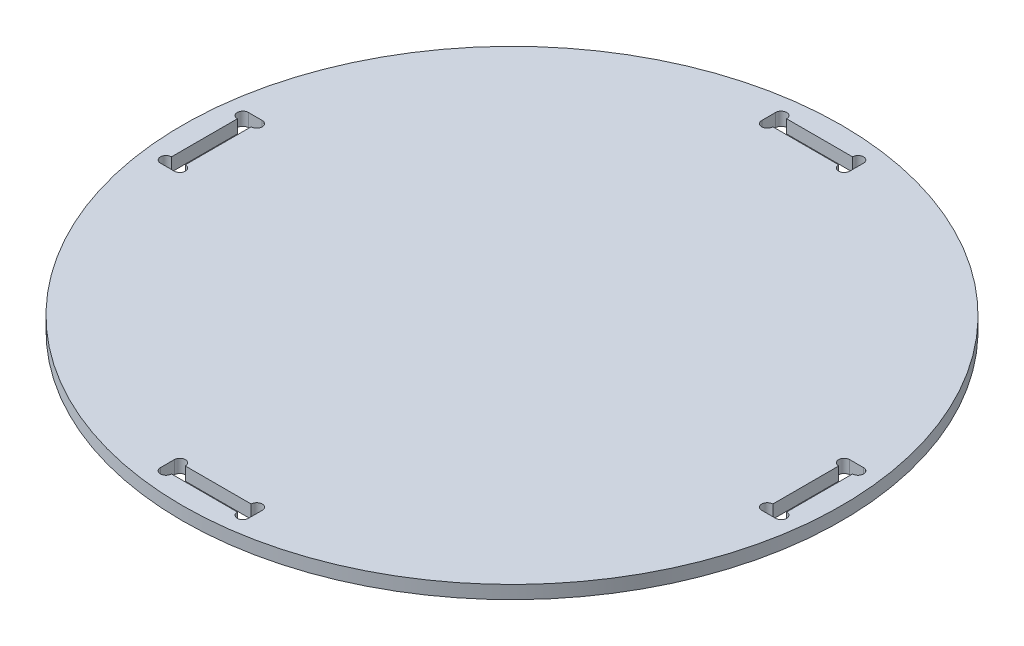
ISO-10303-21;
HEADER;
FILE_DESCRIPTION(('STEP AP214'),'2;1');
FILE_NAME('part.step','',(''),(''),'','','');
FILE_SCHEMA(('AUTOMOTIVE_DESIGN { 1 0 10303 214 1 1 1 1 }'));
ENDSEC;
DATA;
#1=APPLICATION_CONTEXT('core data for automotive mechanical design processes');
#2=APPLICATION_PROTOCOL_DEFINITION('international standard','automotive_design',2000,#1);
#3=PRODUCT_CONTEXT('',#1,'mechanical');
#4=PRODUCT('Part','Part','',(#3));
#5=PRODUCT_RELATED_PRODUCT_CATEGORY('part','',(#4));
#6=PRODUCT_DEFINITION_FORMATION('','',#4);
#7=PRODUCT_DEFINITION_CONTEXT('part definition',#1,'design');
#8=PRODUCT_DEFINITION('design','',#6,#7);
#9=PRODUCT_DEFINITION_SHAPE('','',#8);
#10=(LENGTH_UNIT() NAMED_UNIT(*) SI_UNIT(.MILLI.,.METRE.));
#11=(NAMED_UNIT(*) PLANE_ANGLE_UNIT() SI_UNIT($,.RADIAN.));
#12=(NAMED_UNIT(*) SI_UNIT($,.STERADIAN.) SOLID_ANGLE_UNIT());
#13=UNCERTAINTY_MEASURE_WITH_UNIT(LENGTH_MEASURE(1.E-05),#10,'distance_accuracy_value','');
#14=(GEOMETRIC_REPRESENTATION_CONTEXT(3) GLOBAL_UNCERTAINTY_ASSIGNED_CONTEXT((#13)) GLOBAL_UNIT_ASSIGNED_CONTEXT((#10,
#11,#12)) REPRESENTATION_CONTEXT('',''));
#15=CARTESIAN_POINT('',(0.,0.,0.));
#16=DIRECTION('',(0.,0.,1.));
#17=DIRECTION('',(1.,0.,0.));
#18=AXIS2_PLACEMENT_3D('',#15,#16,#17);
#19=CARTESIAN_POINT('',(0.,12.,0.));
#20=DIRECTION('',(0.,-1.,0.));
#21=DIRECTION('',(0.,0.,-1.));
#22=AXIS2_PLACEMENT_3D('',#19,#20,#21);
#23=CYLINDRICAL_SURFACE('',#22,300.);
#24=CARTESIAN_POINT('',(0.,12.,0.));
#25=DIRECTION('',(0.,1.,0.));
#26=DIRECTION('',(0.,0.,1.));
#27=AXIS2_PLACEMENT_3D('',#24,#25,#26);
#28=CIRCLE('',#27,300.);
#29=CARTESIAN_POINT('',(0.,12.,300.));
#30=VERTEX_POINT('',#29);
#31=EDGE_CURVE('E11',#30,#30,#28,.T.);
#32=ORIENTED_EDGE('',*,*,#31,.F.);
#33=EDGE_LOOP('',(#32));
#34=FACE_BOUND('',#33,.T.);
#35=CARTESIAN_POINT('',(0.,0.,0.));
#36=DIRECTION('',(0.,1.,0.));
#37=DIRECTION('',(0.,0.,1.));
#38=AXIS2_PLACEMENT_3D('',#35,#36,#37);
#39=CIRCLE('',#38,300.);
#40=CARTESIAN_POINT('',(0.,0.,300.));
#41=VERTEX_POINT('',#40);
#42=EDGE_CURVE('E37',#41,#41,#39,.T.);
#43=ORIENTED_EDGE('',*,*,#42,.T.);
#44=EDGE_LOOP('',(#43));
#45=FACE_BOUND('',#44,.T.);
#46=ADVANCED_FACE('F34',(#34,#45),#23,.T.);
#47=CARTESIAN_POINT('',(0.,12.,0.));
#48=DIRECTION('',(0.,1.,0.));
#49=DIRECTION('',(0.,0.,1.));
#50=AXIS2_PLACEMENT_3D('',#47,#48,#49);
#51=PLANE('',#50);
#52=CARTESIAN_POINT('',(34.9998061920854,12.,-280.044023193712));
#53=DIRECTION('',(0.,1.,0.));
#54=DIRECTION('',(0.,0.,-1.));
#55=AXIS2_PLACEMENT_3D('',#52,#53,#54);
#56=CIRCLE('',#55,5.);
#57=CARTESIAN_POINT('',(39.9996123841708,12.,-280.));
#58=VERTEX_POINT('',#57);
#59=CARTESIAN_POINT('',(30.,12.,-280.));
#60=VERTEX_POINT('',#59);
#61=EDGE_CURVE('E48',#58,#60,#56,.T.);
#62=ORIENTED_EDGE('',*,*,#61,.F.);
#63=DIRECTION('',(0.,0.,-1.));
#64=VECTOR('',#63,1.);
#65=CARTESIAN_POINT('',(39.9996123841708,12.,-280.));
#66=LINE('',#65,#64);
#67=CARTESIAN_POINT('',(39.9996123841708,12.,-267.4));
#68=VERTEX_POINT('',#67);
#69=EDGE_CURVE('E264',#68,#58,#66,.T.);
#70=ORIENTED_EDGE('',*,*,#69,.F.);
#71=CARTESIAN_POINT('',(34.9998061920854,12.,-267.355976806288));
#72=DIRECTION('',(0.,1.,0.));
#73=DIRECTION('',(0.,0.,1.));
#74=AXIS2_PLACEMENT_3D('',#71,#72,#73);
#75=CIRCLE('',#74,5.00000000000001);
#76=CARTESIAN_POINT('',(30.,12.,-267.4));
#77=VERTEX_POINT('',#76);
#78=EDGE_CURVE('E267',#77,#68,#75,.T.);
#79=ORIENTED_EDGE('',*,*,#78,.F.);
#80=DIRECTION('',(1.,0.,0.));
#81=VECTOR('',#80,1.);
#82=CARTESIAN_POINT('',(-30.,12.,-267.4));
#83=LINE('',#82,#81);
#84=CARTESIAN_POINT('',(-30.,12.,-267.4));
#85=VERTEX_POINT('',#84);
#86=EDGE_CURVE('E296',#85,#77,#83,.T.);
#87=ORIENTED_EDGE('',*,*,#86,.F.);
#88=CARTESIAN_POINT('',(-34.9998061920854,12.,-267.355976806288));
#89=DIRECTION('',(0.,1.,0.));
#90=DIRECTION('',(0.,0.,-1.));
#91=AXIS2_PLACEMENT_3D('',#88,#89,#90);
#92=CIRCLE('',#91,5.);
#93=CARTESIAN_POINT('',(-39.9996123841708,12.,-267.4));
#94=VERTEX_POINT('',#93);
#95=EDGE_CURVE('E293',#94,#85,#92,.T.);
#96=ORIENTED_EDGE('',*,*,#95,.F.);
#97=DIRECTION('',(0.,0.,1.));
#98=VECTOR('',#97,1.);
#99=CARTESIAN_POINT('',(-39.9996123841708,12.,-280.));
#100=LINE('',#99,#98);
#101=CARTESIAN_POINT('',(-39.9996123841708,12.,-280.));
#102=VERTEX_POINT('',#101);
#103=EDGE_CURVE('E290',#102,#94,#100,.T.);
#104=ORIENTED_EDGE('',*,*,#103,.F.);
#105=CARTESIAN_POINT('',(-34.9998061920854,12.,-280.044023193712));
#106=DIRECTION('',(0.,1.,0.));
#107=DIRECTION('',(0.,0.,1.));
#108=AXIS2_PLACEMENT_3D('',#105,#106,#107);
#109=CIRCLE('',#108,5.);
#110=CARTESIAN_POINT('',(-30.,12.,-280.));
#111=VERTEX_POINT('',#110);
#112=EDGE_CURVE('E287',#111,#102,#109,.T.);
#113=ORIENTED_EDGE('',*,*,#112,.F.);
#114=DIRECTION('',(-1.,0.,0.));
#115=VECTOR('',#114,1.);
#116=CARTESIAN_POINT('',(-30.,12.,-280.));
#117=LINE('',#116,#115);
#118=EDGE_CURVE('E284',#60,#111,#117,.T.);
#119=ORIENTED_EDGE('',*,*,#118,.F.);
#120=EDGE_LOOP('',(#62,#70,#79,#87,#96,#104,#113,#119));
#121=FACE_BOUND('',#120,.T.);
#122=CARTESIAN_POINT('',(280.044023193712,12.,34.9998061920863));
#123=DIRECTION('',(0.,1.,0.));
#124=DIRECTION('',(0.,0.,-1.));
#125=AXIS2_PLACEMENT_3D('',#122,#123,#124);
#126=CIRCLE('',#125,5.);
#127=CARTESIAN_POINT('',(280.,12.,39.9996123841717));
#128=VERTEX_POINT('',#127);
#129=CARTESIAN_POINT('',(280.,12.,30.0000000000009));
#130=VERTEX_POINT('',#129);
#131=EDGE_CURVE('E56',#128,#130,#126,.T.);
#132=ORIENTED_EDGE('',*,*,#131,.F.);
#133=DIRECTION('',(1.,0.,0.));
#134=VECTOR('',#133,1.);
#135=CARTESIAN_POINT('',(280.,12.,39.9996123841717));
#136=LINE('',#135,#134);
#137=CARTESIAN_POINT('',(267.4,12.,39.9996123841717));
#138=VERTEX_POINT('',#137);
#139=EDGE_CURVE('E318',#138,#128,#136,.T.);
#140=ORIENTED_EDGE('',*,*,#139,.F.);
#141=CARTESIAN_POINT('',(267.355976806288,12.,34.9998061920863));
#142=DIRECTION('',(0.,1.,0.));
#143=DIRECTION('',(0.,0.,1.));
#144=AXIS2_PLACEMENT_3D('',#141,#142,#143);
#145=CIRCLE('',#144,5.00000000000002);
#146=CARTESIAN_POINT('',(267.4,12.,30.0000000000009));
#147=VERTEX_POINT('',#146);
#148=EDGE_CURVE('E357',#147,#138,#145,.T.);
#149=ORIENTED_EDGE('',*,*,#148,.F.);
#150=DIRECTION('',(0.,0.,1.));
#151=VECTOR('',#150,1.);
#152=CARTESIAN_POINT('',(267.4,12.,-29.9999999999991));
#153=LINE('',#152,#151);
#154=CARTESIAN_POINT('',(267.4,12.,-29.9999999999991));
#155=VERTEX_POINT('',#154);
#156=EDGE_CURVE('E354',#155,#147,#153,.T.);
#157=ORIENTED_EDGE('',*,*,#156,.F.);
#158=CARTESIAN_POINT('',(267.355976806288,12.,-34.9998061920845));
#159=DIRECTION('',(0.,1.,0.));
#160=DIRECTION('',(0.,0.,-1.));
#161=AXIS2_PLACEMENT_3D('',#158,#159,#160);
#162=CIRCLE('',#161,5.);
#163=CARTESIAN_POINT('',(267.4,12.,-39.9996123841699));
#164=VERTEX_POINT('',#163);
#165=EDGE_CURVE('E351',#164,#155,#162,.T.);
#166=ORIENTED_EDGE('',*,*,#165,.F.);
#167=DIRECTION('',(-1.,0.,0.));
#168=VECTOR('',#167,1.);
#169=CARTESIAN_POINT('',(280.,12.,-39.9996123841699));
#170=LINE('',#169,#168);
#171=CARTESIAN_POINT('',(280.,12.,-39.9996123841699));
#172=VERTEX_POINT('',#171);
#173=EDGE_CURVE('E348',#172,#164,#170,.T.);
#174=ORIENTED_EDGE('',*,*,#173,.F.);
#175=CARTESIAN_POINT('',(280.044023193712,12.,-34.9998061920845));
#176=DIRECTION('',(0.,1.,0.));
#177=DIRECTION('',(0.,0.,1.));
#178=AXIS2_PLACEMENT_3D('',#175,#176,#177);
#179=CIRCLE('',#178,5.);
#180=CARTESIAN_POINT('',(280.,12.,-29.9999999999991));
#181=VERTEX_POINT('',#180);
#182=EDGE_CURVE('E345',#181,#172,#179,.T.);
#183=ORIENTED_EDGE('',*,*,#182,.F.);
#184=DIRECTION('',(0.,0.,-1.));
#185=VECTOR('',#184,1.);
#186=CARTESIAN_POINT('',(280.,12.,-29.9999999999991));
#187=LINE('',#186,#185);
#188=EDGE_CURVE('E341',#130,#181,#187,.T.);
#189=ORIENTED_EDGE('',*,*,#188,.F.);
#190=EDGE_LOOP('',(#132,#140,#149,#157,#166,#174,#183,#189));
#191=FACE_BOUND('',#190,.T.);
#192=CARTESIAN_POINT('',(-34.9998061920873,12.,280.044023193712));
#193=DIRECTION('',(0.,1.,0.));
#194=DIRECTION('',(0.,0.,-1.));
#195=AXIS2_PLACEMENT_3D('',#192,#193,#194);
#196=CIRCLE('',#195,5.);
#197=CARTESIAN_POINT('',(-39.9996123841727,12.,280.));
#198=VERTEX_POINT('',#197);
#199=CARTESIAN_POINT('',(-30.000000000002,12.,280.));
#200=VERTEX_POINT('',#199);
#201=EDGE_CURVE('E402',#198,#200,#196,.T.);
#202=ORIENTED_EDGE('',*,*,#201,.F.);
#203=DIRECTION('',(0.,0.,1.));
#204=VECTOR('',#203,1.);
#205=CARTESIAN_POINT('',(-39.9996123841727,12.,280.));
#206=LINE('',#205,#204);
#207=CARTESIAN_POINT('',(-39.9996123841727,12.,267.4));
#208=VERTEX_POINT('',#207);
#209=EDGE_CURVE('E380',#208,#198,#206,.T.);
#210=ORIENTED_EDGE('',*,*,#209,.F.);
#211=CARTESIAN_POINT('',(-34.9998061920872,12.,267.355976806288));
#212=DIRECTION('',(0.,1.,0.));
#213=DIRECTION('',(0.,0.,1.));
#214=AXIS2_PLACEMENT_3D('',#211,#212,#213);
#215=CIRCLE('',#214,5.00000000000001);
#216=CARTESIAN_POINT('',(-30.0000000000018,12.,267.4));
#217=VERTEX_POINT('',#216);
#218=EDGE_CURVE('E420',#217,#208,#215,.T.);
#219=ORIENTED_EDGE('',*,*,#218,.F.);
#220=DIRECTION('',(-1.,0.,0.));
#221=VECTOR('',#220,1.);
#222=CARTESIAN_POINT('',(29.9999999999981,12.,267.4));
#223=LINE('',#222,#221);
#224=CARTESIAN_POINT('',(29.9999999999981,12.,267.4));
#225=VERTEX_POINT('',#224);
#226=EDGE_CURVE('E417',#225,#217,#223,.T.);
#227=ORIENTED_EDGE('',*,*,#226,.F.);
#228=CARTESIAN_POINT('',(34.9998061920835,12.,267.355976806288));
#229=DIRECTION('',(0.,1.,0.));
#230=DIRECTION('',(0.,0.,-1.));
#231=AXIS2_PLACEMENT_3D('',#228,#229,#230);
#232=CIRCLE('',#231,5.);
#233=CARTESIAN_POINT('',(39.9996123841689,12.,267.4));
#234=VERTEX_POINT('',#233);
#235=EDGE_CURVE('E414',#234,#225,#232,.T.);
#236=ORIENTED_EDGE('',*,*,#235,.F.);
#237=DIRECTION('',(0.,0.,-1.));
#238=VECTOR('',#237,1.);
#239=CARTESIAN_POINT('',(39.9996123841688,12.,280.));
#240=LINE('',#239,#238);
#241=CARTESIAN_POINT('',(39.9996123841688,12.,280.));
#242=VERTEX_POINT('',#241);
#243=EDGE_CURVE('E411',#242,#234,#240,.T.);
#244=ORIENTED_EDGE('',*,*,#243,.F.);
#245=CARTESIAN_POINT('',(34.9998061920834,12.,280.044023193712));
#246=DIRECTION('',(0.,1.,0.));
#247=DIRECTION('',(0.,0.,1.));
#248=AXIS2_PLACEMENT_3D('',#245,#246,#247);
#249=CIRCLE('',#248,5.);
#250=CARTESIAN_POINT('',(29.999999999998,12.,280.));
#251=VERTEX_POINT('',#250);
#252=EDGE_CURVE('E408',#251,#242,#249,.T.);
#253=ORIENTED_EDGE('',*,*,#252,.F.);
#254=DIRECTION('',(1.,0.,0.));
#255=VECTOR('',#254,1.);
#256=CARTESIAN_POINT('',(29.999999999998,12.,280.));
#257=LINE('',#256,#255);
#258=EDGE_CURVE('E404',#200,#251,#257,.T.);
#259=ORIENTED_EDGE('',*,*,#258,.F.);
#260=EDGE_LOOP('',(#202,#210,#219,#227,#236,#244,#253,#259));
#261=FACE_BOUND('',#260,.T.);
#262=CARTESIAN_POINT('',(-280.044023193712,12.,-34.9998061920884));
#263=DIRECTION('',(0.,1.,0.));
#264=DIRECTION('',(0.,0.,-1.));
#265=AXIS2_PLACEMENT_3D('',#262,#263,#264);
#266=CIRCLE('',#265,5.);
#267=CARTESIAN_POINT('',(-280.,12.,-39.9996123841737));
#268=VERTEX_POINT('',#267);
#269=CARTESIAN_POINT('',(-280.,12.,-30.000000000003));
#270=VERTEX_POINT('',#269);
#271=EDGE_CURVE('E466',#268,#270,#266,.T.);
#272=ORIENTED_EDGE('',*,*,#271,.F.);
#273=DIRECTION('',(-1.,0.,0.));
#274=VECTOR('',#273,1.);
#275=CARTESIAN_POINT('',(-280.,12.,-39.9996123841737));
#276=LINE('',#275,#274);
#277=CARTESIAN_POINT('',(-267.4,12.,-39.9996123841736));
#278=VERTEX_POINT('',#277);
#279=EDGE_CURVE('E444',#278,#268,#276,.T.);
#280=ORIENTED_EDGE('',*,*,#279,.F.);
#281=CARTESIAN_POINT('',(-267.355976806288,12.,-34.9998061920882));
#282=DIRECTION('',(0.,1.,0.));
#283=DIRECTION('',(0.,0.,1.));
#284=AXIS2_PLACEMENT_3D('',#281,#282,#283);
#285=CIRCLE('',#284,5.00000000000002);
#286=CARTESIAN_POINT('',(-267.4,12.,-30.0000000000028));
#287=VERTEX_POINT('',#286);
#288=EDGE_CURVE('E483',#287,#278,#285,.T.);
#289=ORIENTED_EDGE('',*,*,#288,.F.);
#290=DIRECTION('',(0.,0.,-1.));
#291=VECTOR('',#290,1.);
#292=CARTESIAN_POINT('',(-267.4,12.,29.9999999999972));
#293=LINE('',#292,#291);
#294=CARTESIAN_POINT('',(-267.4,12.,29.9999999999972));
#295=VERTEX_POINT('',#294);
#296=EDGE_CURVE('E480',#295,#287,#293,.T.);
#297=ORIENTED_EDGE('',*,*,#296,.F.);
#298=CARTESIAN_POINT('',(-267.355976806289,12.,34.9998061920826));
#299=DIRECTION('',(0.,1.,0.));
#300=DIRECTION('',(0.,0.,-1.));
#301=AXIS2_PLACEMENT_3D('',#298,#299,#300);
#302=CIRCLE('',#301,5.);
#303=CARTESIAN_POINT('',(-267.400000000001,12.,39.999612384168));
#304=VERTEX_POINT('',#303);
#305=EDGE_CURVE('E477',#304,#295,#302,.T.);
#306=ORIENTED_EDGE('',*,*,#305,.F.);
#307=DIRECTION('',(1.,0.,0.));
#308=VECTOR('',#307,1.);
#309=CARTESIAN_POINT('',(-280.000000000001,12.,39.9996123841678));
#310=LINE('',#309,#308);
#311=CARTESIAN_POINT('',(-280.000000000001,12.,39.9996123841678));
#312=VERTEX_POINT('',#311);
#313=EDGE_CURVE('E474',#312,#304,#310,.T.);
#314=ORIENTED_EDGE('',*,*,#313,.F.);
#315=CARTESIAN_POINT('',(-280.044023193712,12.,34.9998061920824));
#316=DIRECTION('',(0.,1.,0.));
#317=DIRECTION('',(0.,0.,1.));
#318=AXIS2_PLACEMENT_3D('',#315,#316,#317);
#319=CIRCLE('',#318,5.);
#320=CARTESIAN_POINT('',(-280.,12.,29.999999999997));
#321=VERTEX_POINT('',#320);
#322=EDGE_CURVE('E471',#321,#312,#319,.T.);
#323=ORIENTED_EDGE('',*,*,#322,.F.);
#324=DIRECTION('',(0.,0.,1.));
#325=VECTOR('',#324,1.);
#326=CARTESIAN_POINT('',(-280.,12.,29.999999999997));
#327=LINE('',#326,#325);
#328=EDGE_CURVE('E468',#270,#321,#327,.T.);
#329=ORIENTED_EDGE('',*,*,#328,.F.);
#330=EDGE_LOOP('',(#272,#280,#289,#297,#306,#314,#323,#329));
#331=FACE_BOUND('',#330,.T.);
#332=ORIENTED_EDGE('',*,*,#31,.T.);
#333=EDGE_LOOP('',(#332));
#334=FACE_BOUND('',#333,.T.);
#335=ADVANCED_FACE('F512',(#121,#191,#261,#331,#334),#51,.T.);
#336=CARTESIAN_POINT('',(0.,0.,0.));
#337=DIRECTION('',(0.,1.,0.));
#338=DIRECTION('',(0.,0.,1.));
#339=AXIS2_PLACEMENT_3D('',#336,#337,#338);
#340=PLANE('',#339);
#341=DIRECTION('',(0.,0.,-1.));
#342=VECTOR('',#341,1.);
#343=CARTESIAN_POINT('',(39.9996123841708,0.,-280.));
#344=LINE('',#343,#342);
#345=CARTESIAN_POINT('',(39.9996123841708,0.,-267.4));
#346=VERTEX_POINT('',#345);
#347=CARTESIAN_POINT('',(39.9996123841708,0.,-280.));
#348=VERTEX_POINT('',#347);
#349=EDGE_CURVE('E250',#346,#348,#344,.T.);
#350=ORIENTED_EDGE('',*,*,#349,.T.);
#351=CARTESIAN_POINT('',(34.9998061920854,0.,-280.044023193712));
#352=DIRECTION('',(0.,1.,0.));
#353=DIRECTION('',(0.,0.,-1.));
#354=AXIS2_PLACEMENT_3D('',#351,#352,#353);
#355=CIRCLE('',#354,5.);
#356=CARTESIAN_POINT('',(30.,0.,-280.));
#357=VERTEX_POINT('',#356);
#358=EDGE_CURVE('E244',#348,#357,#355,.T.);
#359=ORIENTED_EDGE('',*,*,#358,.T.);
#360=DIRECTION('',(-1.,0.,0.));
#361=VECTOR('',#360,1.);
#362=CARTESIAN_POINT('',(-30.,0.,-280.));
#363=LINE('',#362,#361);
#364=CARTESIAN_POINT('',(-30.,0.,-280.));
#365=VERTEX_POINT('',#364);
#366=EDGE_CURVE('E254',#357,#365,#363,.T.);
#367=ORIENTED_EDGE('',*,*,#366,.T.);
#368=CARTESIAN_POINT('',(-34.9998061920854,0.,-280.044023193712));
#369=DIRECTION('',(0.,1.,0.));
#370=DIRECTION('',(0.,0.,1.));
#371=AXIS2_PLACEMENT_3D('',#368,#369,#370);
#372=CIRCLE('',#371,5.);
#373=CARTESIAN_POINT('',(-39.9996123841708,0.,-280.));
#374=VERTEX_POINT('',#373);
#375=EDGE_CURVE('E258',#365,#374,#372,.T.);
#376=ORIENTED_EDGE('',*,*,#375,.T.);
#377=DIRECTION('',(0.,0.,1.));
#378=VECTOR('',#377,1.);
#379=CARTESIAN_POINT('',(-39.9996123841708,0.,-280.));
#380=LINE('',#379,#378);
#381=CARTESIAN_POINT('',(-39.9996123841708,0.,-267.4));
#382=VERTEX_POINT('',#381);
#383=EDGE_CURVE('E271',#374,#382,#380,.T.);
#384=ORIENTED_EDGE('',*,*,#383,.T.);
#385=CARTESIAN_POINT('',(-34.9998061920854,0.,-267.355976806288));
#386=DIRECTION('',(0.,1.,0.));
#387=DIRECTION('',(0.,0.,-1.));
#388=AXIS2_PLACEMENT_3D('',#385,#386,#387);
#389=CIRCLE('',#388,5.);
#390=CARTESIAN_POINT('',(-30.,0.,-267.4));
#391=VERTEX_POINT('',#390);
#392=EDGE_CURVE('E274',#382,#391,#389,.T.);
#393=ORIENTED_EDGE('',*,*,#392,.T.);
#394=DIRECTION('',(1.,0.,0.));
#395=VECTOR('',#394,1.);
#396=CARTESIAN_POINT('',(-30.,0.,-267.4));
#397=LINE('',#396,#395);
#398=CARTESIAN_POINT('',(30.,0.,-267.4));
#399=VERTEX_POINT('',#398);
#400=EDGE_CURVE('E277',#391,#399,#397,.T.);
#401=ORIENTED_EDGE('',*,*,#400,.T.);
#402=CARTESIAN_POINT('',(34.9998061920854,0.,-267.355976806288));
#403=DIRECTION('',(0.,1.,0.));
#404=DIRECTION('',(0.,0.,1.));
#405=AXIS2_PLACEMENT_3D('',#402,#403,#404);
#406=CIRCLE('',#405,5.00000000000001);
#407=EDGE_CURVE('E280',#399,#346,#406,.T.);
#408=ORIENTED_EDGE('',*,*,#407,.T.);
#409=EDGE_LOOP('',(#350,#359,#367,#376,#384,#393,#401,#408));
#410=FACE_BOUND('',#409,.T.);
#411=DIRECTION('',(1.,0.,0.));
#412=VECTOR('',#411,1.);
#413=CARTESIAN_POINT('',(280.,0.,39.9996123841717));
#414=LINE('',#413,#412);
#415=CARTESIAN_POINT('',(267.4,0.,39.9996123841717));
#416=VERTEX_POINT('',#415);
#417=CARTESIAN_POINT('',(280.,0.,39.9996123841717));
#418=VERTEX_POINT('',#417);
#419=EDGE_CURVE('E336',#416,#418,#414,.T.);
#420=ORIENTED_EDGE('',*,*,#419,.T.);
#421=CARTESIAN_POINT('',(280.044023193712,0.,34.9998061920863));
#422=DIRECTION('',(0.,1.,0.));
#423=DIRECTION('',(0.,0.,-1.));
#424=AXIS2_PLACEMENT_3D('',#421,#422,#423);
#425=CIRCLE('',#424,5.);
#426=CARTESIAN_POINT('',(280.,0.,30.0000000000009));
#427=VERTEX_POINT('',#426);
#428=EDGE_CURVE('E314',#418,#427,#425,.T.);
#429=ORIENTED_EDGE('',*,*,#428,.T.);
#430=DIRECTION('',(0.,0.,-1.));
#431=VECTOR('',#430,1.);
#432=CARTESIAN_POINT('',(280.,0.,-29.9999999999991));
#433=LINE('',#432,#431);
#434=CARTESIAN_POINT('',(280.,0.,-29.9999999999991));
#435=VERTEX_POINT('',#434);
#436=EDGE_CURVE('E317',#427,#435,#433,.T.);
#437=ORIENTED_EDGE('',*,*,#436,.T.);
#438=CARTESIAN_POINT('',(280.044023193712,0.,-34.9998061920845));
#439=DIRECTION('',(0.,1.,0.));
#440=DIRECTION('',(0.,0.,1.));
#441=AXIS2_PLACEMENT_3D('',#438,#439,#440);
#442=CIRCLE('',#441,5.);
#443=CARTESIAN_POINT('',(280.,0.,-39.9996123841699));
#444=VERTEX_POINT('',#443);
#445=EDGE_CURVE('E321',#435,#444,#442,.T.);
#446=ORIENTED_EDGE('',*,*,#445,.T.);
#447=DIRECTION('',(-1.,0.,0.));
#448=VECTOR('',#447,1.);
#449=CARTESIAN_POINT('',(280.,0.,-39.9996123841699));
#450=LINE('',#449,#448);
#451=CARTESIAN_POINT('',(267.4,0.,-39.9996123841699));
#452=VERTEX_POINT('',#451);
#453=EDGE_CURVE('E324',#444,#452,#450,.T.);
#454=ORIENTED_EDGE('',*,*,#453,.T.);
#455=CARTESIAN_POINT('',(267.355976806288,0.,-34.9998061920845));
#456=DIRECTION('',(0.,1.,0.));
#457=DIRECTION('',(0.,0.,-1.));
#458=AXIS2_PLACEMENT_3D('',#455,#456,#457);
#459=CIRCLE('',#458,5.);
#460=CARTESIAN_POINT('',(267.4,0.,-29.9999999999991));
#461=VERTEX_POINT('',#460);
#462=EDGE_CURVE('E327',#452,#461,#459,.T.);
#463=ORIENTED_EDGE('',*,*,#462,.T.);
#464=DIRECTION('',(0.,0.,1.));
#465=VECTOR('',#464,1.);
#466=CARTESIAN_POINT('',(267.4,0.,-29.9999999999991));
#467=LINE('',#466,#465);
#468=CARTESIAN_POINT('',(267.4,0.,30.0000000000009));
#469=VERTEX_POINT('',#468);
#470=EDGE_CURVE('E330',#461,#469,#467,.T.);
#471=ORIENTED_EDGE('',*,*,#470,.T.);
#472=CARTESIAN_POINT('',(267.355976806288,0.,34.9998061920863));
#473=DIRECTION('',(0.,1.,0.));
#474=DIRECTION('',(0.,0.,1.));
#475=AXIS2_PLACEMENT_3D('',#472,#473,#474);
#476=CIRCLE('',#475,5.00000000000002);
#477=EDGE_CURVE('E333',#469,#416,#476,.T.);
#478=ORIENTED_EDGE('',*,*,#477,.T.);
#479=EDGE_LOOP('',(#420,#429,#437,#446,#454,#463,#471,#478));
#480=FACE_BOUND('',#479,.T.);
#481=DIRECTION('',(0.,0.,1.));
#482=VECTOR('',#481,1.);
#483=CARTESIAN_POINT('',(-39.9996123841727,0.,280.));
#484=LINE('',#483,#482);
#485=CARTESIAN_POINT('',(-39.9996123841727,0.,267.4));
#486=VERTEX_POINT('',#485);
#487=CARTESIAN_POINT('',(-39.9996123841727,0.,280.));
#488=VERTEX_POINT('',#487);
#489=EDGE_CURVE('E398',#486,#488,#484,.T.);
#490=ORIENTED_EDGE('',*,*,#489,.T.);
#491=CARTESIAN_POINT('',(-34.9998061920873,0.,280.044023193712));
#492=DIRECTION('',(0.,1.,0.));
#493=DIRECTION('',(0.,0.,-1.));
#494=AXIS2_PLACEMENT_3D('',#491,#492,#493);
#495=CIRCLE('',#494,5.);
#496=CARTESIAN_POINT('',(-30.000000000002,0.,280.));
#497=VERTEX_POINT('',#496);
#498=EDGE_CURVE('E376',#488,#497,#495,.T.);
#499=ORIENTED_EDGE('',*,*,#498,.T.);
#500=DIRECTION('',(1.,0.,0.));
#501=VECTOR('',#500,1.);
#502=CARTESIAN_POINT('',(29.999999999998,0.,280.));
#503=LINE('',#502,#501);
#504=CARTESIAN_POINT('',(29.999999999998,0.,280.));
#505=VERTEX_POINT('',#504);
#506=EDGE_CURVE('E379',#497,#505,#503,.T.);
#507=ORIENTED_EDGE('',*,*,#506,.T.);
#508=CARTESIAN_POINT('',(34.9998061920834,0.,280.044023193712));
#509=DIRECTION('',(0.,1.,0.));
#510=DIRECTION('',(0.,0.,1.));
#511=AXIS2_PLACEMENT_3D('',#508,#509,#510);
#512=CIRCLE('',#511,5.);
#513=CARTESIAN_POINT('',(39.9996123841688,0.,280.));
#514=VERTEX_POINT('',#513);
#515=EDGE_CURVE('E383',#505,#514,#512,.T.);
#516=ORIENTED_EDGE('',*,*,#515,.T.);
#517=DIRECTION('',(0.,0.,-1.));
#518=VECTOR('',#517,1.);
#519=CARTESIAN_POINT('',(39.9996123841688,0.,280.));
#520=LINE('',#519,#518);
#521=CARTESIAN_POINT('',(39.9996123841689,0.,267.4));
#522=VERTEX_POINT('',#521);
#523=EDGE_CURVE('E386',#514,#522,#520,.T.);
#524=ORIENTED_EDGE('',*,*,#523,.T.);
#525=CARTESIAN_POINT('',(34.9998061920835,0.,267.355976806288));
#526=DIRECTION('',(0.,1.,0.));
#527=DIRECTION('',(0.,0.,-1.));
#528=AXIS2_PLACEMENT_3D('',#525,#526,#527);
#529=CIRCLE('',#528,5.);
#530=CARTESIAN_POINT('',(29.9999999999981,0.,267.4));
#531=VERTEX_POINT('',#530);
#532=EDGE_CURVE('E389',#522,#531,#529,.T.);
#533=ORIENTED_EDGE('',*,*,#532,.T.);
#534=DIRECTION('',(-1.,0.,0.));
#535=VECTOR('',#534,1.);
#536=CARTESIAN_POINT('',(29.9999999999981,0.,267.4));
#537=LINE('',#536,#535);
#538=CARTESIAN_POINT('',(-30.0000000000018,0.,267.4));
#539=VERTEX_POINT('',#538);
#540=EDGE_CURVE('E392',#531,#539,#537,.T.);
#541=ORIENTED_EDGE('',*,*,#540,.T.);
#542=CARTESIAN_POINT('',(-34.9998061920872,0.,267.355976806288));
#543=DIRECTION('',(0.,1.,0.));
#544=DIRECTION('',(0.,0.,1.));
#545=AXIS2_PLACEMENT_3D('',#542,#543,#544);
#546=CIRCLE('',#545,5.00000000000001);
#547=EDGE_CURVE('E395',#539,#486,#546,.T.);
#548=ORIENTED_EDGE('',*,*,#547,.T.);
#549=EDGE_LOOP('',(#490,#499,#507,#516,#524,#533,#541,#548));
#550=FACE_BOUND('',#549,.T.);
#551=DIRECTION('',(-1.,0.,0.));
#552=VECTOR('',#551,1.);
#553=CARTESIAN_POINT('',(-280.,0.,-39.9996123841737));
#554=LINE('',#553,#552);
#555=CARTESIAN_POINT('',(-267.4,0.,-39.9996123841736));
#556=VERTEX_POINT('',#555);
#557=CARTESIAN_POINT('',(-280.,0.,-39.9996123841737));
#558=VERTEX_POINT('',#557);
#559=EDGE_CURVE('E462',#556,#558,#554,.T.);
#560=ORIENTED_EDGE('',*,*,#559,.T.);
#561=CARTESIAN_POINT('',(-280.044023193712,0.,-34.9998061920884));
#562=DIRECTION('',(0.,1.,0.));
#563=DIRECTION('',(0.,0.,-1.));
#564=AXIS2_PLACEMENT_3D('',#561,#562,#563);
#565=CIRCLE('',#564,5.);
#566=CARTESIAN_POINT('',(-280.,0.,-30.000000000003));
#567=VERTEX_POINT('',#566);
#568=EDGE_CURVE('E440',#558,#567,#565,.T.);
#569=ORIENTED_EDGE('',*,*,#568,.T.);
#570=DIRECTION('',(0.,0.,1.));
#571=VECTOR('',#570,1.);
#572=CARTESIAN_POINT('',(-280.,0.,29.999999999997));
#573=LINE('',#572,#571);
#574=CARTESIAN_POINT('',(-280.,0.,29.999999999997));
#575=VERTEX_POINT('',#574);
#576=EDGE_CURVE('E443',#567,#575,#573,.T.);
#577=ORIENTED_EDGE('',*,*,#576,.T.);
#578=CARTESIAN_POINT('',(-280.044023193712,0.,34.9998061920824));
#579=DIRECTION('',(0.,1.,0.));
#580=DIRECTION('',(0.,0.,1.));
#581=AXIS2_PLACEMENT_3D('',#578,#579,#580);
#582=CIRCLE('',#581,5.);
#583=CARTESIAN_POINT('',(-280.000000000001,0.,39.9996123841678));
#584=VERTEX_POINT('',#583);
#585=EDGE_CURVE('E447',#575,#584,#582,.T.);
#586=ORIENTED_EDGE('',*,*,#585,.T.);
#587=DIRECTION('',(1.,0.,0.));
#588=VECTOR('',#587,1.);
#589=CARTESIAN_POINT('',(-280.000000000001,0.,39.9996123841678));
#590=LINE('',#589,#588);
#591=CARTESIAN_POINT('',(-267.400000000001,0.,39.999612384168));
#592=VERTEX_POINT('',#591);
#593=EDGE_CURVE('E450',#584,#592,#590,.T.);
#594=ORIENTED_EDGE('',*,*,#593,.T.);
#595=CARTESIAN_POINT('',(-267.355976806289,0.,34.9998061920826));
#596=DIRECTION('',(0.,1.,0.));
#597=DIRECTION('',(0.,0.,-1.));
#598=AXIS2_PLACEMENT_3D('',#595,#596,#597);
#599=CIRCLE('',#598,5.);
#600=CARTESIAN_POINT('',(-267.4,0.,29.9999999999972));
#601=VERTEX_POINT('',#600);
#602=EDGE_CURVE('E453',#592,#601,#599,.T.);
#603=ORIENTED_EDGE('',*,*,#602,.T.);
#604=DIRECTION('',(0.,0.,-1.));
#605=VECTOR('',#604,1.);
#606=CARTESIAN_POINT('',(-267.4,0.,29.9999999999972));
#607=LINE('',#606,#605);
#608=CARTESIAN_POINT('',(-267.4,0.,-30.0000000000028));
#609=VERTEX_POINT('',#608);
#610=EDGE_CURVE('E456',#601,#609,#607,.T.);
#611=ORIENTED_EDGE('',*,*,#610,.T.);
#612=CARTESIAN_POINT('',(-267.355976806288,0.,-34.9998061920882));
#613=DIRECTION('',(0.,1.,0.));
#614=DIRECTION('',(0.,0.,1.));
#615=AXIS2_PLACEMENT_3D('',#612,#613,#614);
#616=CIRCLE('',#615,5.00000000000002);
#617=EDGE_CURVE('E459',#609,#556,#616,.T.);
#618=ORIENTED_EDGE('',*,*,#617,.T.);
#619=EDGE_LOOP('',(#560,#569,#577,#586,#594,#603,#611,#618));
#620=FACE_BOUND('',#619,.T.);
#621=ORIENTED_EDGE('',*,*,#42,.F.);
#622=EDGE_LOOP('',(#621));
#623=FACE_BOUND('',#622,.T.);
#624=ADVANCED_FACE('F260',(#410,#480,#550,#620,#623),#340,.F.);
#625=CARTESIAN_POINT('',(-280.044023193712,0.,-34.9998061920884));
#626=DIRECTION('',(0.,1.,0.));
#627=DIRECTION('',(0.,0.,1.));
#628=AXIS2_PLACEMENT_3D('',#625,#626,#627);
#629=CYLINDRICAL_SURFACE('',#628,5.);
#630=ORIENTED_EDGE('',*,*,#271,.T.);
#631=DIRECTION('',(0.,1.,0.));
#632=VECTOR('',#631,1.);
#633=CARTESIAN_POINT('',(-280.,0.,-30.000000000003));
#634=LINE('',#633,#632);
#635=EDGE_CURVE('E465',#567,#270,#634,.T.);
#636=ORIENTED_EDGE('',*,*,#635,.F.);
#637=ORIENTED_EDGE('',*,*,#568,.F.);
#638=DIRECTION('',(0.,1.,0.));
#639=VECTOR('',#638,1.);
#640=CARTESIAN_POINT('',(-280.,0.,-39.9996123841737));
#641=LINE('',#640,#639);
#642=EDGE_CURVE('E405',#558,#268,#641,.T.);
#643=ORIENTED_EDGE('',*,*,#642,.T.);
#644=EDGE_LOOP('',(#630,#636,#637,#643));
#645=FACE_BOUND('',#644,.T.);
#646=ADVANCED_FACE('F523',(#645),#629,.F.);
#647=CARTESIAN_POINT('',(-280.,0.,-39.9996123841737));
#648=DIRECTION('',(0.,0.,-1.));
#649=DIRECTION('',(-1.,0.,0.));
#650=AXIS2_PLACEMENT_3D('',#647,#648,#649);
#651=PLANE('',#650);
#652=ORIENTED_EDGE('',*,*,#279,.T.);
#653=ORIENTED_EDGE('',*,*,#642,.F.);
#654=ORIENTED_EDGE('',*,*,#559,.F.);
#655=DIRECTION('',(0.,1.,0.));
#656=VECTOR('',#655,1.);
#657=CARTESIAN_POINT('',(-267.4,0.,-39.9996123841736));
#658=LINE('',#657,#656);
#659=EDGE_CURVE('E489',#556,#278,#658,.T.);
#660=ORIENTED_EDGE('',*,*,#659,.T.);
#661=EDGE_LOOP('',(#652,#653,#654,#660));
#662=FACE_BOUND('',#661,.T.);
#663=ADVANCED_FACE('F525',(#662),#651,.F.);
#664=CARTESIAN_POINT('',(-267.355976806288,0.,-34.9998061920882));
#665=DIRECTION('',(0.,1.,0.));
#666=DIRECTION('',(0.,0.,1.));
#667=AXIS2_PLACEMENT_3D('',#664,#665,#666);
#668=CYLINDRICAL_SURFACE('',#667,5.00000000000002);
#669=ORIENTED_EDGE('',*,*,#288,.T.);
#670=ORIENTED_EDGE('',*,*,#659,.F.);
#671=ORIENTED_EDGE('',*,*,#617,.F.);
#672=DIRECTION('',(0.,1.,0.));
#673=VECTOR('',#672,1.);
#674=CARTESIAN_POINT('',(-267.4,0.,-30.0000000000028));
#675=LINE('',#674,#673);
#676=EDGE_CURVE('E491',#609,#287,#675,.T.);
#677=ORIENTED_EDGE('',*,*,#676,.T.);
#678=EDGE_LOOP('',(#669,#670,#671,#677));
#679=FACE_BOUND('',#678,.T.);
#680=ADVANCED_FACE('F529',(#679),#668,.F.);
#681=CARTESIAN_POINT('',(-267.4,0.,29.9999999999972));
#682=DIRECTION('',(1.,0.,0.));
#683=DIRECTION('',(0.,0.,-1.));
#684=AXIS2_PLACEMENT_3D('',#681,#682,#683);
#685=PLANE('',#684);
#686=ORIENTED_EDGE('',*,*,#296,.T.);
#687=ORIENTED_EDGE('',*,*,#676,.F.);
#688=ORIENTED_EDGE('',*,*,#610,.F.);
#689=DIRECTION('',(0.,1.,0.));
#690=VECTOR('',#689,1.);
#691=CARTESIAN_POINT('',(-267.4,0.,29.9999999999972));
#692=LINE('',#691,#690);
#693=EDGE_CURVE('E493',#601,#295,#692,.T.);
#694=ORIENTED_EDGE('',*,*,#693,.T.);
#695=EDGE_LOOP('',(#686,#687,#688,#694));
#696=FACE_BOUND('',#695,.T.);
#697=ADVANCED_FACE('F533',(#696),#685,.F.);
#698=CARTESIAN_POINT('',(-267.355976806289,0.,34.9998061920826));
#699=DIRECTION('',(0.,1.,0.));
#700=DIRECTION('',(0.,0.,1.));
#701=AXIS2_PLACEMENT_3D('',#698,#699,#700);
#702=CYLINDRICAL_SURFACE('',#701,5.);
#703=ORIENTED_EDGE('',*,*,#305,.T.);
#704=ORIENTED_EDGE('',*,*,#693,.F.);
#705=ORIENTED_EDGE('',*,*,#602,.F.);
#706=DIRECTION('',(0.,1.,0.));
#707=VECTOR('',#706,1.);
#708=CARTESIAN_POINT('',(-267.400000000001,0.,39.999612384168));
#709=LINE('',#708,#707);
#710=EDGE_CURVE('E495',#592,#304,#709,.T.);
#711=ORIENTED_EDGE('',*,*,#710,.T.);
#712=EDGE_LOOP('',(#703,#704,#705,#711));
#713=FACE_BOUND('',#712,.T.);
#714=ADVANCED_FACE('F536',(#713),#702,.F.);
#715=CARTESIAN_POINT('',(-280.000000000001,0.,39.9996123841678));
#716=DIRECTION('',(0.,0.,1.));
#717=DIRECTION('',(1.,0.,0.));
#718=AXIS2_PLACEMENT_3D('',#715,#716,#717);
#719=PLANE('',#718);
#720=ORIENTED_EDGE('',*,*,#313,.T.);
#721=ORIENTED_EDGE('',*,*,#710,.F.);
#722=ORIENTED_EDGE('',*,*,#593,.F.);
#723=DIRECTION('',(0.,1.,0.));
#724=VECTOR('',#723,1.);
#725=CARTESIAN_POINT('',(-280.000000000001,0.,39.9996123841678));
#726=LINE('',#725,#724);
#727=EDGE_CURVE('E497',#584,#312,#726,.T.);
#728=ORIENTED_EDGE('',*,*,#727,.T.);
#729=EDGE_LOOP('',(#720,#721,#722,#728));
#730=FACE_BOUND('',#729,.T.);
#731=ADVANCED_FACE('F538',(#730),#719,.F.);
#732=CARTESIAN_POINT('',(-280.044023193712,0.,34.9998061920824));
#733=DIRECTION('',(0.,1.,0.));
#734=DIRECTION('',(0.,0.,1.));
#735=AXIS2_PLACEMENT_3D('',#732,#733,#734);
#736=CYLINDRICAL_SURFACE('',#735,5.);
#737=ORIENTED_EDGE('',*,*,#322,.T.);
#738=ORIENTED_EDGE('',*,*,#727,.F.);
#739=ORIENTED_EDGE('',*,*,#585,.F.);
#740=DIRECTION('',(0.,1.,0.));
#741=VECTOR('',#740,1.);
#742=CARTESIAN_POINT('',(-280.,0.,29.999999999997));
#743=LINE('',#742,#741);
#744=EDGE_CURVE('E499',#575,#321,#743,.T.);
#745=ORIENTED_EDGE('',*,*,#744,.T.);
#746=EDGE_LOOP('',(#737,#738,#739,#745));
#747=FACE_BOUND('',#746,.T.);
#748=ADVANCED_FACE('F518',(#747),#736,.F.);
#749=CARTESIAN_POINT('',(-280.,0.,29.999999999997));
#750=DIRECTION('',(-1.,0.,0.));
#751=DIRECTION('',(0.,0.,1.));
#752=AXIS2_PLACEMENT_3D('',#749,#750,#751);
#753=PLANE('',#752);
#754=ORIENTED_EDGE('',*,*,#328,.T.);
#755=ORIENTED_EDGE('',*,*,#744,.F.);
#756=ORIENTED_EDGE('',*,*,#576,.F.);
#757=ORIENTED_EDGE('',*,*,#635,.T.);
#758=EDGE_LOOP('',(#754,#755,#756,#757));
#759=FACE_BOUND('',#758,.T.);
#760=ADVANCED_FACE('F505',(#759),#753,.F.);
#761=CARTESIAN_POINT('',(-34.9998061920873,0.,280.044023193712));
#762=DIRECTION('',(0.,1.,0.));
#763=DIRECTION('',(0.,0.,1.));
#764=AXIS2_PLACEMENT_3D('',#761,#762,#763);
#765=CYLINDRICAL_SURFACE('',#764,5.);
#766=ORIENTED_EDGE('',*,*,#201,.T.);
#767=DIRECTION('',(0.,1.,0.));
#768=VECTOR('',#767,1.);
#769=CARTESIAN_POINT('',(-30.000000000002,0.,280.));
#770=LINE('',#769,#768);
#771=EDGE_CURVE('E401',#497,#200,#770,.T.);
#772=ORIENTED_EDGE('',*,*,#771,.F.);
#773=ORIENTED_EDGE('',*,*,#498,.F.);
#774=DIRECTION('',(0.,1.,0.));
#775=VECTOR('',#774,1.);
#776=CARTESIAN_POINT('',(-39.9996123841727,0.,280.));
#777=LINE('',#776,#775);
#778=EDGE_CURVE('E342',#488,#198,#777,.T.);
#779=ORIENTED_EDGE('',*,*,#778,.T.);
#780=EDGE_LOOP('',(#766,#772,#773,#779));
#781=FACE_BOUND('',#780,.T.);
#782=ADVANCED_FACE('F565',(#781),#765,.F.);
#783=CARTESIAN_POINT('',(-39.9996123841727,0.,280.));
#784=DIRECTION('',(-1.,0.,0.));
#785=DIRECTION('',(0.,0.,1.));
#786=AXIS2_PLACEMENT_3D('',#783,#784,#785);
#787=PLANE('',#786);
#788=ORIENTED_EDGE('',*,*,#209,.T.);
#789=ORIENTED_EDGE('',*,*,#778,.F.);
#790=ORIENTED_EDGE('',*,*,#489,.F.);
#791=DIRECTION('',(0.,1.,0.));
#792=VECTOR('',#791,1.);
#793=CARTESIAN_POINT('',(-39.9996123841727,0.,267.4));
#794=LINE('',#793,#792);
#795=EDGE_CURVE('E426',#486,#208,#794,.T.);
#796=ORIENTED_EDGE('',*,*,#795,.T.);
#797=EDGE_LOOP('',(#788,#789,#790,#796));
#798=FACE_BOUND('',#797,.T.);
#799=ADVANCED_FACE('F569',(#798),#787,.F.);
#800=CARTESIAN_POINT('',(-34.9998061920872,0.,267.355976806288));
#801=DIRECTION('',(0.,1.,0.));
#802=DIRECTION('',(0.,0.,1.));
#803=AXIS2_PLACEMENT_3D('',#800,#801,#802);
#804=CYLINDRICAL_SURFACE('',#803,5.00000000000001);
#805=ORIENTED_EDGE('',*,*,#218,.T.);
#806=ORIENTED_EDGE('',*,*,#795,.F.);
#807=ORIENTED_EDGE('',*,*,#547,.F.);
#808=DIRECTION('',(0.,1.,0.));
#809=VECTOR('',#808,1.);
#810=CARTESIAN_POINT('',(-30.0000000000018,0.,267.4));
#811=LINE('',#810,#809);
#812=EDGE_CURVE('E428',#539,#217,#811,.T.);
#813=ORIENTED_EDGE('',*,*,#812,.T.);
#814=EDGE_LOOP('',(#805,#806,#807,#813));
#815=FACE_BOUND('',#814,.T.);
#816=ADVANCED_FACE('F575',(#815),#804,.F.);
#817=CARTESIAN_POINT('',(29.9999999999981,0.,267.4));
#818=DIRECTION('',(0.,0.,-1.));
#819=DIRECTION('',(-1.,0.,0.));
#820=AXIS2_PLACEMENT_3D('',#817,#818,#819);
#821=PLANE('',#820);
#822=ORIENTED_EDGE('',*,*,#226,.T.);
#823=ORIENTED_EDGE('',*,*,#812,.F.);
#824=ORIENTED_EDGE('',*,*,#540,.F.);
#825=DIRECTION('',(0.,1.,0.));
#826=VECTOR('',#825,1.);
#827=CARTESIAN_POINT('',(29.9999999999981,0.,267.4));
#828=LINE('',#827,#826);
#829=EDGE_CURVE('E430',#531,#225,#828,.T.);
#830=ORIENTED_EDGE('',*,*,#829,.T.);
#831=EDGE_LOOP('',(#822,#823,#824,#830));
#832=FACE_BOUND('',#831,.T.);
#833=ADVANCED_FACE('F628',(#832),#821,.F.);
#834=CARTESIAN_POINT('',(34.9998061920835,0.,267.355976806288));
#835=DIRECTION('',(0.,1.,0.));
#836=DIRECTION('',(0.,0.,1.));
#837=AXIS2_PLACEMENT_3D('',#834,#835,#836);
#838=CYLINDRICAL_SURFACE('',#837,5.);
#839=ORIENTED_EDGE('',*,*,#235,.T.);
#840=ORIENTED_EDGE('',*,*,#829,.F.);
#841=ORIENTED_EDGE('',*,*,#532,.F.);
#842=DIRECTION('',(0.,1.,0.));
#843=VECTOR('',#842,1.);
#844=CARTESIAN_POINT('',(39.9996123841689,0.,267.4));
#845=LINE('',#844,#843);
#846=EDGE_CURVE('E432',#522,#234,#845,.T.);
#847=ORIENTED_EDGE('',*,*,#846,.T.);
#848=EDGE_LOOP('',(#839,#840,#841,#847));
#849=FACE_BOUND('',#848,.T.);
#850=ADVANCED_FACE('F638',(#849),#838,.F.);
#851=CARTESIAN_POINT('',(39.9996123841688,0.,280.));
#852=DIRECTION('',(1.,0.,0.));
#853=DIRECTION('',(0.,0.,-1.));
#854=AXIS2_PLACEMENT_3D('',#851,#852,#853);
#855=PLANE('',#854);
#856=ORIENTED_EDGE('',*,*,#243,.T.);
#857=ORIENTED_EDGE('',*,*,#846,.F.);
#858=ORIENTED_EDGE('',*,*,#523,.F.);
#859=DIRECTION('',(0.,1.,0.));
#860=VECTOR('',#859,1.);
#861=CARTESIAN_POINT('',(39.9996123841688,0.,280.));
#862=LINE('',#861,#860);
#863=EDGE_CURVE('E434',#514,#242,#862,.T.);
#864=ORIENTED_EDGE('',*,*,#863,.T.);
#865=EDGE_LOOP('',(#856,#857,#858,#864));
#866=FACE_BOUND('',#865,.T.);
#867=ADVANCED_FACE('F648',(#866),#855,.F.);
#868=CARTESIAN_POINT('',(34.9998061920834,0.,280.044023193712));
#869=DIRECTION('',(0.,1.,0.));
#870=DIRECTION('',(0.,0.,1.));
#871=AXIS2_PLACEMENT_3D('',#868,#869,#870);
#872=CYLINDRICAL_SURFACE('',#871,5.);
#873=ORIENTED_EDGE('',*,*,#252,.T.);
#874=ORIENTED_EDGE('',*,*,#863,.F.);
#875=ORIENTED_EDGE('',*,*,#515,.F.);
#876=DIRECTION('',(0.,1.,0.));
#877=VECTOR('',#876,1.);
#878=CARTESIAN_POINT('',(29.999999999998,0.,280.));
#879=LINE('',#878,#877);
#880=EDGE_CURVE('E436',#505,#251,#879,.T.);
#881=ORIENTED_EDGE('',*,*,#880,.T.);
#882=EDGE_LOOP('',(#873,#874,#875,#881));
#883=FACE_BOUND('',#882,.T.);
#884=ADVANCED_FACE('F658',(#883),#872,.F.);
#885=CARTESIAN_POINT('',(29.999999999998,0.,280.));
#886=DIRECTION('',(0.,0.,1.));
#887=DIRECTION('',(1.,0.,0.));
#888=AXIS2_PLACEMENT_3D('',#885,#886,#887);
#889=PLANE('',#888);
#890=ORIENTED_EDGE('',*,*,#258,.T.);
#891=ORIENTED_EDGE('',*,*,#880,.F.);
#892=ORIENTED_EDGE('',*,*,#506,.F.);
#893=ORIENTED_EDGE('',*,*,#771,.T.);
#894=EDGE_LOOP('',(#890,#891,#892,#893));
#895=FACE_BOUND('',#894,.T.);
#896=ADVANCED_FACE('F580',(#895),#889,.F.);
#897=CARTESIAN_POINT('',(280.044023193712,0.,34.9998061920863));
#898=DIRECTION('',(0.,1.,0.));
#899=DIRECTION('',(0.,0.,1.));
#900=AXIS2_PLACEMENT_3D('',#897,#898,#899);
#901=CYLINDRICAL_SURFACE('',#900,5.);
#902=ORIENTED_EDGE('',*,*,#131,.T.);
#903=DIRECTION('',(0.,1.,0.));
#904=VECTOR('',#903,1.);
#905=CARTESIAN_POINT('',(280.,0.,30.0000000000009));
#906=LINE('',#905,#904);
#907=EDGE_CURVE('E339',#427,#130,#906,.T.);
#908=ORIENTED_EDGE('',*,*,#907,.F.);
#909=ORIENTED_EDGE('',*,*,#428,.F.);
#910=DIRECTION('',(0.,1.,0.));
#911=VECTOR('',#910,1.);
#912=CARTESIAN_POINT('',(280.,0.,39.9996123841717));
#913=LINE('',#912,#911);
#914=EDGE_CURVE('E285',#418,#128,#913,.T.);
#915=ORIENTED_EDGE('',*,*,#914,.T.);
#916=EDGE_LOOP('',(#902,#908,#909,#915));
#917=FACE_BOUND('',#916,.T.);
#918=ADVANCED_FACE('F676',(#917),#901,.F.);
#919=CARTESIAN_POINT('',(280.,0.,39.9996123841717));
#920=DIRECTION('',(0.,0.,1.));
#921=DIRECTION('',(1.,0.,0.));
#922=AXIS2_PLACEMENT_3D('',#919,#920,#921);
#923=PLANE('',#922);
#924=ORIENTED_EDGE('',*,*,#139,.T.);
#925=ORIENTED_EDGE('',*,*,#914,.F.);
#926=ORIENTED_EDGE('',*,*,#419,.F.);
#927=DIRECTION('',(0.,1.,0.));
#928=VECTOR('',#927,1.);
#929=CARTESIAN_POINT('',(267.4,0.,39.9996123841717));
#930=LINE('',#929,#928);
#931=EDGE_CURVE('E363',#416,#138,#930,.T.);
#932=ORIENTED_EDGE('',*,*,#931,.T.);
#933=EDGE_LOOP('',(#924,#925,#926,#932));
#934=FACE_BOUND('',#933,.T.);
#935=ADVANCED_FACE('F685',(#934),#923,.F.);
#936=CARTESIAN_POINT('',(267.355976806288,0.,34.9998061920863));
#937=DIRECTION('',(0.,1.,0.));
#938=DIRECTION('',(0.,0.,1.));
#939=AXIS2_PLACEMENT_3D('',#936,#937,#938);
#940=CYLINDRICAL_SURFACE('',#939,5.00000000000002);
#941=ORIENTED_EDGE('',*,*,#148,.T.);
#942=ORIENTED_EDGE('',*,*,#931,.F.);
#943=ORIENTED_EDGE('',*,*,#477,.F.);
#944=DIRECTION('',(0.,1.,0.));
#945=VECTOR('',#944,1.);
#946=CARTESIAN_POINT('',(267.4,0.,30.0000000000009));
#947=LINE('',#946,#945);
#948=EDGE_CURVE('E365',#469,#147,#947,.T.);
#949=ORIENTED_EDGE('',*,*,#948,.T.);
#950=EDGE_LOOP('',(#941,#942,#943,#949));
#951=FACE_BOUND('',#950,.T.);
#952=ADVANCED_FACE('F694',(#951),#940,.F.);
#953=CARTESIAN_POINT('',(267.4,0.,-29.9999999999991));
#954=DIRECTION('',(-1.,0.,0.));
#955=DIRECTION('',(0.,0.,1.));
#956=AXIS2_PLACEMENT_3D('',#953,#954,#955);
#957=PLANE('',#956);
#958=ORIENTED_EDGE('',*,*,#156,.T.);
#959=ORIENTED_EDGE('',*,*,#948,.F.);
#960=ORIENTED_EDGE('',*,*,#470,.F.);
#961=DIRECTION('',(0.,1.,0.));
#962=VECTOR('',#961,1.);
#963=CARTESIAN_POINT('',(267.4,0.,-29.9999999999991));
#964=LINE('',#963,#962);
#965=EDGE_CURVE('E367',#461,#155,#964,.T.);
#966=ORIENTED_EDGE('',*,*,#965,.T.);
#967=EDGE_LOOP('',(#958,#959,#960,#966));
#968=FACE_BOUND('',#967,.T.);
#969=ADVANCED_FACE('F704',(#968),#957,.F.);
#970=CARTESIAN_POINT('',(267.355976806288,0.,-34.9998061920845));
#971=DIRECTION('',(0.,1.,0.));
#972=DIRECTION('',(0.,0.,1.));
#973=AXIS2_PLACEMENT_3D('',#970,#971,#972);
#974=CYLINDRICAL_SURFACE('',#973,5.);
#975=ORIENTED_EDGE('',*,*,#165,.T.);
#976=ORIENTED_EDGE('',*,*,#965,.F.);
#977=ORIENTED_EDGE('',*,*,#462,.F.);
#978=DIRECTION('',(0.,1.,0.));
#979=VECTOR('',#978,1.);
#980=CARTESIAN_POINT('',(267.4,0.,-39.9996123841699));
#981=LINE('',#980,#979);
#982=EDGE_CURVE('E369',#452,#164,#981,.T.);
#983=ORIENTED_EDGE('',*,*,#982,.T.);
#984=EDGE_LOOP('',(#975,#976,#977,#983));
#985=FACE_BOUND('',#984,.T.);
#986=ADVANCED_FACE('F714',(#985),#974,.F.);
#987=CARTESIAN_POINT('',(280.,0.,-39.9996123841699));
#988=DIRECTION('',(0.,0.,-1.));
#989=DIRECTION('',(-1.,0.,0.));
#990=AXIS2_PLACEMENT_3D('',#987,#988,#989);
#991=PLANE('',#990);
#992=ORIENTED_EDGE('',*,*,#173,.T.);
#993=ORIENTED_EDGE('',*,*,#982,.F.);
#994=ORIENTED_EDGE('',*,*,#453,.F.);
#995=DIRECTION('',(0.,1.,0.));
#996=VECTOR('',#995,1.);
#997=CARTESIAN_POINT('',(280.,0.,-39.9996123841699));
#998=LINE('',#997,#996);
#999=EDGE_CURVE('E371',#444,#172,#998,.T.);
#1000=ORIENTED_EDGE('',*,*,#999,.T.);
#1001=EDGE_LOOP('',(#992,#993,#994,#1000));
#1002=FACE_BOUND('',#1001,.T.);
#1003=ADVANCED_FACE('F724',(#1002),#991,.F.);
#1004=CARTESIAN_POINT('',(280.044023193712,0.,-34.9998061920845));
#1005=DIRECTION('',(0.,1.,0.));
#1006=DIRECTION('',(0.,0.,1.));
#1007=AXIS2_PLACEMENT_3D('',#1004,#1005,#1006);
#1008=CYLINDRICAL_SURFACE('',#1007,5.);
#1009=ORIENTED_EDGE('',*,*,#182,.T.);
#1010=ORIENTED_EDGE('',*,*,#999,.F.);
#1011=ORIENTED_EDGE('',*,*,#445,.F.);
#1012=DIRECTION('',(0.,1.,0.));
#1013=VECTOR('',#1012,1.);
#1014=CARTESIAN_POINT('',(280.,0.,-29.9999999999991));
#1015=LINE('',#1014,#1013);
#1016=EDGE_CURVE('E373',#435,#181,#1015,.T.);
#1017=ORIENTED_EDGE('',*,*,#1016,.T.);
#1018=EDGE_LOOP('',(#1009,#1010,#1011,#1017));
#1019=FACE_BOUND('',#1018,.T.);
#1020=ADVANCED_FACE('F734',(#1019),#1008,.F.);
#1021=CARTESIAN_POINT('',(280.,0.,-29.9999999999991));
#1022=DIRECTION('',(1.,0.,0.));
#1023=DIRECTION('',(0.,0.,-1.));
#1024=AXIS2_PLACEMENT_3D('',#1021,#1022,#1023);
#1025=PLANE('',#1024);
#1026=ORIENTED_EDGE('',*,*,#188,.T.);
#1027=ORIENTED_EDGE('',*,*,#1016,.F.);
#1028=ORIENTED_EDGE('',*,*,#436,.F.);
#1029=ORIENTED_EDGE('',*,*,#907,.T.);
#1030=EDGE_LOOP('',(#1026,#1027,#1028,#1029));
#1031=FACE_BOUND('',#1030,.T.);
#1032=ADVANCED_FACE('F744',(#1031),#1025,.F.);
#1033=CARTESIAN_POINT('',(34.9998061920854,0.,-280.044023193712));
#1034=DIRECTION('',(0.,1.,0.));
#1035=DIRECTION('',(0.,0.,1.));
#1036=AXIS2_PLACEMENT_3D('',#1033,#1034,#1035);
#1037=CYLINDRICAL_SURFACE('',#1036,5.);
#1038=ORIENTED_EDGE('',*,*,#61,.T.);
#1039=DIRECTION('',(0.,1.,0.));
#1040=VECTOR('',#1039,1.);
#1041=CARTESIAN_POINT('',(30.,0.,-280.));
#1042=LINE('',#1041,#1040);
#1043=EDGE_CURVE('E240',#357,#60,#1042,.T.);
#1044=ORIENTED_EDGE('',*,*,#1043,.F.);
#1045=ORIENTED_EDGE('',*,*,#358,.F.);
#1046=DIRECTION('',(0.,1.,0.));
#1047=VECTOR('',#1046,1.);
#1048=CARTESIAN_POINT('',(39.9996123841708,0.,-280.));
#1049=LINE('',#1048,#1047);
#1050=EDGE_CURVE('E301',#348,#58,#1049,.T.);
#1051=ORIENTED_EDGE('',*,*,#1050,.T.);
#1052=EDGE_LOOP('',(#1038,#1044,#1045,#1051));
#1053=FACE_BOUND('',#1052,.T.);
#1054=ADVANCED_FACE('F242',(#1053),#1037,.F.);
#1055=CARTESIAN_POINT('',(39.9996123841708,0.,-280.));
#1056=DIRECTION('',(1.,0.,0.));
#1057=DIRECTION('',(0.,0.,-1.));
#1058=AXIS2_PLACEMENT_3D('',#1055,#1056,#1057);
#1059=PLANE('',#1058);
#1060=ORIENTED_EDGE('',*,*,#69,.T.);
#1061=ORIENTED_EDGE('',*,*,#1050,.F.);
#1062=ORIENTED_EDGE('',*,*,#349,.F.);
#1063=DIRECTION('',(0.,1.,0.));
#1064=VECTOR('',#1063,1.);
#1065=CARTESIAN_POINT('',(39.9996123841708,0.,-267.4));
#1066=LINE('',#1065,#1064);
#1067=EDGE_CURVE('E303',#346,#68,#1066,.T.);
#1068=ORIENTED_EDGE('',*,*,#1067,.T.);
#1069=EDGE_LOOP('',(#1060,#1061,#1062,#1068));
#1070=FACE_BOUND('',#1069,.T.);
#1071=ADVANCED_FACE('F763',(#1070),#1059,.F.);
#1072=CARTESIAN_POINT('',(34.9998061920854,0.,-267.355976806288));
#1073=DIRECTION('',(0.,1.,0.));
#1074=DIRECTION('',(0.,0.,1.));
#1075=AXIS2_PLACEMENT_3D('',#1072,#1073,#1074);
#1076=CYLINDRICAL_SURFACE('',#1075,5.00000000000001);
#1077=ORIENTED_EDGE('',*,*,#78,.T.);
#1078=ORIENTED_EDGE('',*,*,#1067,.F.);
#1079=ORIENTED_EDGE('',*,*,#407,.F.);
#1080=DIRECTION('',(0.,1.,0.));
#1081=VECTOR('',#1080,1.);
#1082=CARTESIAN_POINT('',(30.,0.,-267.4));
#1083=LINE('',#1082,#1081);
#1084=EDGE_CURVE('E305',#399,#77,#1083,.T.);
#1085=ORIENTED_EDGE('',*,*,#1084,.T.);
#1086=EDGE_LOOP('',(#1077,#1078,#1079,#1085));
#1087=FACE_BOUND('',#1086,.T.);
#1088=ADVANCED_FACE('F772',(#1087),#1076,.F.);
#1089=CARTESIAN_POINT('',(-30.,0.,-267.4));
#1090=DIRECTION('',(0.,0.,1.));
#1091=DIRECTION('',(1.,0.,0.));
#1092=AXIS2_PLACEMENT_3D('',#1089,#1090,#1091);
#1093=PLANE('',#1092);
#1094=ORIENTED_EDGE('',*,*,#86,.T.);
#1095=ORIENTED_EDGE('',*,*,#1084,.F.);
#1096=ORIENTED_EDGE('',*,*,#400,.F.);
#1097=DIRECTION('',(0.,1.,0.));
#1098=VECTOR('',#1097,1.);
#1099=CARTESIAN_POINT('',(-30.,0.,-267.4));
#1100=LINE('',#1099,#1098);
#1101=EDGE_CURVE('E307',#391,#85,#1100,.T.);
#1102=ORIENTED_EDGE('',*,*,#1101,.T.);
#1103=EDGE_LOOP('',(#1094,#1095,#1096,#1102));
#1104=FACE_BOUND('',#1103,.T.);
#1105=ADVANCED_FACE('F782',(#1104),#1093,.F.);
#1106=CARTESIAN_POINT('',(-34.9998061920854,0.,-267.355976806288));
#1107=DIRECTION('',(0.,1.,0.));
#1108=DIRECTION('',(0.,0.,1.));
#1109=AXIS2_PLACEMENT_3D('',#1106,#1107,#1108);
#1110=CYLINDRICAL_SURFACE('',#1109,5.);
#1111=ORIENTED_EDGE('',*,*,#95,.T.);
#1112=ORIENTED_EDGE('',*,*,#1101,.F.);
#1113=ORIENTED_EDGE('',*,*,#392,.F.);
#1114=DIRECTION('',(0.,1.,0.));
#1115=VECTOR('',#1114,1.);
#1116=CARTESIAN_POINT('',(-39.9996123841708,0.,-267.4));
#1117=LINE('',#1116,#1115);
#1118=EDGE_CURVE('E309',#382,#94,#1117,.T.);
#1119=ORIENTED_EDGE('',*,*,#1118,.T.);
#1120=EDGE_LOOP('',(#1111,#1112,#1113,#1119));
#1121=FACE_BOUND('',#1120,.T.);
#1122=ADVANCED_FACE('F792',(#1121),#1110,.F.);
#1123=CARTESIAN_POINT('',(-39.9996123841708,0.,-280.));
#1124=DIRECTION('',(-1.,0.,0.));
#1125=DIRECTION('',(0.,0.,1.));
#1126=AXIS2_PLACEMENT_3D('',#1123,#1124,#1125);
#1127=PLANE('',#1126);
#1128=ORIENTED_EDGE('',*,*,#103,.T.);
#1129=ORIENTED_EDGE('',*,*,#1118,.F.);
#1130=ORIENTED_EDGE('',*,*,#383,.F.);
#1131=DIRECTION('',(0.,1.,0.));
#1132=VECTOR('',#1131,1.);
#1133=CARTESIAN_POINT('',(-39.9996123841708,0.,-280.));
#1134=LINE('',#1133,#1132);
#1135=EDGE_CURVE('E311',#374,#102,#1134,.T.);
#1136=ORIENTED_EDGE('',*,*,#1135,.T.);
#1137=EDGE_LOOP('',(#1128,#1129,#1130,#1136));
#1138=FACE_BOUND('',#1137,.T.);
#1139=ADVANCED_FACE('F802',(#1138),#1127,.F.);
#1140=CARTESIAN_POINT('',(-34.9998061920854,0.,-280.044023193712));
#1141=DIRECTION('',(0.,1.,0.));
#1142=DIRECTION('',(0.,0.,1.));
#1143=AXIS2_PLACEMENT_3D('',#1140,#1141,#1142);
#1144=CYLINDRICAL_SURFACE('',#1143,5.);
#1145=ORIENTED_EDGE('',*,*,#112,.T.);
#1146=ORIENTED_EDGE('',*,*,#1135,.F.);
#1147=ORIENTED_EDGE('',*,*,#375,.F.);
#1148=DIRECTION('',(0.,1.,0.));
#1149=VECTOR('',#1148,1.);
#1150=CARTESIAN_POINT('',(-30.,0.,-280.));
#1151=LINE('',#1150,#1149);
#1152=EDGE_CURVE('E249',#365,#111,#1151,.T.);
#1153=ORIENTED_EDGE('',*,*,#1152,.T.);
#1154=EDGE_LOOP('',(#1145,#1146,#1147,#1153));
#1155=FACE_BOUND('',#1154,.T.);
#1156=ADVANCED_FACE('F812',(#1155),#1144,.F.);
#1157=CARTESIAN_POINT('',(-30.,0.,-280.));
#1158=DIRECTION('',(0.,0.,-1.));
#1159=DIRECTION('',(-1.,0.,0.));
#1160=AXIS2_PLACEMENT_3D('',#1157,#1158,#1159);
#1161=PLANE('',#1160);
#1162=ORIENTED_EDGE('',*,*,#118,.T.);
#1163=ORIENTED_EDGE('',*,*,#1152,.F.);
#1164=ORIENTED_EDGE('',*,*,#366,.F.);
#1165=ORIENTED_EDGE('',*,*,#1043,.T.);
#1166=EDGE_LOOP('',(#1162,#1163,#1164,#1165));
#1167=FACE_BOUND('',#1166,.T.);
#1168=ADVANCED_FACE('F255',(#1167),#1161,.F.);
#1169=CLOSED_SHELL('',(#46,#335,#624,#646,#663,#680,#697,#714,#731,#748,#760,#782,#799,#816,
#833,#850,#867,#884,#896,#918,#935,#952,#969,#986,#1003,#1020,#1032,#1054,#1071,#1088,#1105,
#1122,#1139,#1156,#1168));
#1170=MANIFOLD_SOLID_BREP('B2',#1169);
#1171=ADVANCED_BREP_SHAPE_REPRESENTATION('',(#18,#1170),#14);
#1172=SHAPE_DEFINITION_REPRESENTATION(#9,#1171);
ENDSEC;
END-ISO-10303-21;
